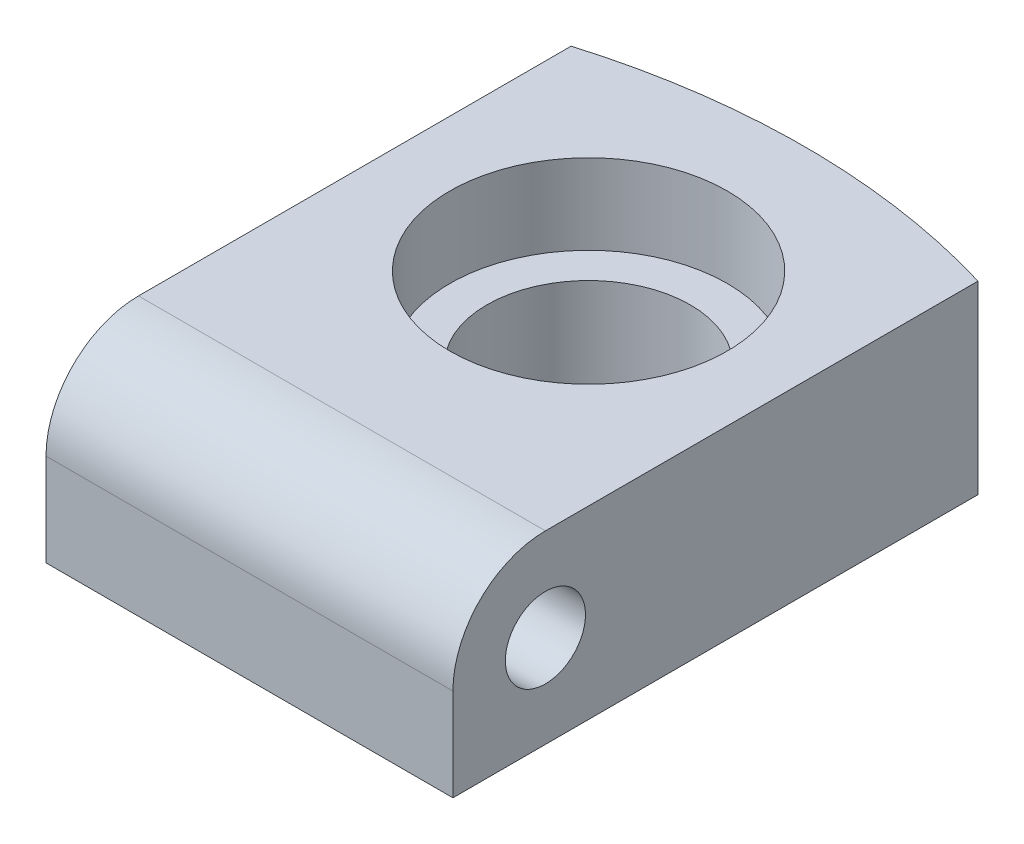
ISO-10303-21;
HEADER;
FILE_DESCRIPTION(('STEP AP214'),'2;1');
FILE_NAME('part.step','',(''),(''),'','','');
FILE_SCHEMA(('AUTOMOTIVE_DESIGN { 1 0 10303 214 1 1 1 1 }'));
ENDSEC;
DATA;
#1=APPLICATION_CONTEXT('core data for automotive mechanical design processes');
#2=APPLICATION_PROTOCOL_DEFINITION('international standard','automotive_design',2000,#1);
#3=PRODUCT_CONTEXT('',#1,'mechanical');
#4=PRODUCT('Part','Part','',(#3));
#5=PRODUCT_RELATED_PRODUCT_CATEGORY('part','',(#4));
#6=PRODUCT_DEFINITION_FORMATION('','',#4);
#7=PRODUCT_DEFINITION_CONTEXT('part definition',#1,'design');
#8=PRODUCT_DEFINITION('design','',#6,#7);
#9=PRODUCT_DEFINITION_SHAPE('','',#8);
#10=(LENGTH_UNIT() NAMED_UNIT(*) SI_UNIT(.MILLI.,.METRE.));
#11=(NAMED_UNIT(*) PLANE_ANGLE_UNIT() SI_UNIT($,.RADIAN.));
#12=(NAMED_UNIT(*) SI_UNIT($,.STERADIAN.) SOLID_ANGLE_UNIT());
#13=UNCERTAINTY_MEASURE_WITH_UNIT(LENGTH_MEASURE(1.E-05),#10,'distance_accuracy_value','');
#14=(GEOMETRIC_REPRESENTATION_CONTEXT(3) GLOBAL_UNCERTAINTY_ASSIGNED_CONTEXT((#13)) GLOBAL_UNIT_ASSIGNED_CONTEXT((#10,
#11,#12)) REPRESENTATION_CONTEXT('',''));
#15=CARTESIAN_POINT('',(0.,0.,0.));
#16=DIRECTION('',(0.,0.,1.));
#17=DIRECTION('',(1.,0.,0.));
#18=AXIS2_PLACEMENT_3D('',#15,#16,#17);
#19=CARTESIAN_POINT('',(-66.,0.,0.));
#20=DIRECTION('',(0.,-1.,0.));
#21=DIRECTION('',(0.,0.,-1.));
#22=AXIS2_PLACEMENT_3D('',#19,#20,#21);
#23=PLANE('',#22);
#24=CARTESIAN_POINT('',(-33.,0.,35.));
#25=DIRECTION('',(0.,1.,0.));
#26=DIRECTION('',(0.,0.,1.));
#27=AXIS2_PLACEMENT_3D('',#24,#25,#26);
#28=CIRCLE('',#27,16.5);
#29=CARTESIAN_POINT('',(-33.,0.,51.5));
#30=VERTEX_POINT('',#29);
#31=EDGE_CURVE('E145',#30,#30,#28,.T.);
#32=ORIENTED_EDGE('',*,*,#31,.T.);
#33=EDGE_LOOP('',(#32));
#34=FACE_BOUND('',#33,.T.);
#35=CARTESIAN_POINT('',(-33.,0.,115.));
#36=DIRECTION('',(0.,1.,0.));
#37=DIRECTION('',(0.,0.,1.));
#38=AXIS2_PLACEMENT_3D('',#35,#36,#37);
#39=CIRCLE('',#38,115.);
#40=CARTESIAN_POINT('',(-66.,0.,4.83648516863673));
#41=VERTEX_POINT('',#40);
#42=CARTESIAN_POINT('',(0.,0.,4.83648516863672));
#43=VERTEX_POINT('',#42);
#44=EDGE_CURVE('E68',#41,#43,#39,.F.);
#45=ORIENTED_EDGE('',*,*,#44,.T.);
#46=DIRECTION('',(0.,0.,-1.));
#47=VECTOR('',#46,1.);
#48=CARTESIAN_POINT('',(0.,0.,0.));
#49=LINE('',#48,#47);
#50=CARTESIAN_POINT('',(0.,0.,90.));
#51=VERTEX_POINT('',#50);
#52=EDGE_CURVE('E118',#51,#43,#49,.T.);
#53=ORIENTED_EDGE('',*,*,#52,.F.);
#54=DIRECTION('',(1.,0.,0.));
#55=VECTOR('',#54,1.);
#56=CARTESIAN_POINT('',(-66.,0.,90.));
#57=LINE('',#56,#55);
#58=CARTESIAN_POINT('',(-66.,0.,90.));
#59=VERTEX_POINT('',#58);
#60=EDGE_CURVE('E12',#59,#51,#57,.T.);
#61=ORIENTED_EDGE('',*,*,#60,.F.);
#62=DIRECTION('',(0.,0.,-1.));
#63=VECTOR('',#62,1.);
#64=CARTESIAN_POINT('',(-66.,0.,0.));
#65=LINE('',#64,#63);
#66=EDGE_CURVE('E130',#59,#41,#65,.T.);
#67=ORIENTED_EDGE('',*,*,#66,.T.);
#68=EDGE_LOOP('',(#45,#53,#61,#67));
#69=FACE_BOUND('',#68,.T.);
#70=ADVANCED_FACE('F51',(#34,#69),#23,.T.);
#71=CARTESIAN_POINT('',(-66.,30.,0.));
#72=DIRECTION('',(0.,1.,0.));
#73=DIRECTION('',(0.,0.,1.));
#74=AXIS2_PLACEMENT_3D('',#71,#72,#73);
#75=PLANE('',#74);
#76=CARTESIAN_POINT('',(-33.,30.,35.));
#77=DIRECTION('',(0.,1.,0.));
#78=DIRECTION('',(0.,0.,1.));
#79=AXIS2_PLACEMENT_3D('',#76,#77,#78);
#80=CIRCLE('',#79,22.5);
#81=CARTESIAN_POINT('',(-33.,30.,57.5));
#82=VERTEX_POINT('',#81);
#83=EDGE_CURVE('E154',#82,#82,#80,.T.);
#84=ORIENTED_EDGE('',*,*,#83,.F.);
#85=EDGE_LOOP('',(#84));
#86=FACE_BOUND('',#85,.T.);
#87=DIRECTION('',(0.,0.,1.));
#88=VECTOR('',#87,1.);
#89=CARTESIAN_POINT('',(0.,30.,0.));
#90=LINE('',#89,#88);
#91=CARTESIAN_POINT('',(0.,30.,4.83648516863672));
#92=VERTEX_POINT('',#91);
#93=CARTESIAN_POINT('',(0.,30.,74.9999999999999));
#94=VERTEX_POINT('',#93);
#95=EDGE_CURVE('E117',#92,#94,#90,.T.);
#96=ORIENTED_EDGE('',*,*,#95,.F.);
#97=CARTESIAN_POINT('',(-33.,30.,115.));
#98=DIRECTION('',(0.,1.,0.));
#99=DIRECTION('',(0.,0.,1.));
#100=AXIS2_PLACEMENT_3D('',#97,#98,#99);
#101=CIRCLE('',#100,115.);
#102=CARTESIAN_POINT('',(-66.,30.,4.83648516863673));
#103=VERTEX_POINT('',#102);
#104=EDGE_CURVE('E105',#103,#92,#101,.F.);
#105=ORIENTED_EDGE('',*,*,#104,.F.);
#106=DIRECTION('',(0.,0.,1.));
#107=VECTOR('',#106,1.);
#108=CARTESIAN_POINT('',(-66.,30.,0.));
#109=LINE('',#108,#107);
#110=CARTESIAN_POINT('',(-66.,30.,74.9999999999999));
#111=VERTEX_POINT('',#110);
#112=EDGE_CURVE('E97',#103,#111,#109,.T.);
#113=ORIENTED_EDGE('',*,*,#112,.T.);
#114=DIRECTION('',(1.,0.,0.));
#115=VECTOR('',#114,1.);
#116=CARTESIAN_POINT('',(-66.,30.,74.9999999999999));
#117=LINE('',#116,#115);
#118=EDGE_CURVE('E55',#111,#94,#117,.T.);
#119=ORIENTED_EDGE('',*,*,#118,.T.);
#120=EDGE_LOOP('',(#96,#105,#113,#119));
#121=FACE_BOUND('',#120,.T.);
#122=ADVANCED_FACE('F53',(#86,#121),#75,.T.);
#123=CARTESIAN_POINT('',(-66.,0.,90.));
#124=DIRECTION('',(0.,0.,1.));
#125=DIRECTION('',(1.,0.,0.));
#126=AXIS2_PLACEMENT_3D('',#123,#124,#125);
#127=PLANE('',#126);
#128=DIRECTION('',(0.,-1.,0.));
#129=VECTOR('',#128,1.);
#130=CARTESIAN_POINT('',(0.,0.,90.));
#131=LINE('',#130,#129);
#132=CARTESIAN_POINT('',(0.,14.9999999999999,90.));
#133=VERTEX_POINT('',#132);
#134=EDGE_CURVE('E124',#133,#51,#131,.T.);
#135=ORIENTED_EDGE('',*,*,#134,.F.);
#136=DIRECTION('',(1.,0.,0.));
#137=VECTOR('',#136,1.);
#138=CARTESIAN_POINT('',(-66.,14.9999999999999,90.));
#139=LINE('',#138,#137);
#140=CARTESIAN_POINT('',(-66.,14.9999999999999,90.));
#141=VERTEX_POINT('',#140);
#142=EDGE_CURVE('E60',#141,#133,#139,.T.);
#143=ORIENTED_EDGE('',*,*,#142,.F.);
#144=DIRECTION('',(0.,-1.,0.));
#145=VECTOR('',#144,1.);
#146=CARTESIAN_POINT('',(-66.,0.,90.));
#147=LINE('',#146,#145);
#148=EDGE_CURVE('E136',#141,#59,#147,.T.);
#149=ORIENTED_EDGE('',*,*,#148,.T.);
#150=ORIENTED_EDGE('',*,*,#60,.T.);
#151=EDGE_LOOP('',(#135,#143,#149,#150));
#152=FACE_BOUND('',#151,.T.);
#153=ADVANCED_FACE('F164',(#152),#127,.T.);
#154=CARTESIAN_POINT('',(-66.,15.,75.));
#155=DIRECTION('',(1.,0.,0.));
#156=DIRECTION('',(0.,0.,-1.));
#157=AXIS2_PLACEMENT_3D('',#154,#155,#156);
#158=CYLINDRICAL_SURFACE('',#157,15.);
#159=CARTESIAN_POINT('',(0.,15.,75.));
#160=DIRECTION('',(1.,0.,0.));
#161=DIRECTION('',(0.,0.,-1.));
#162=AXIS2_PLACEMENT_3D('',#159,#160,#161);
#163=CIRCLE('',#162,15.);
#164=EDGE_CURVE('E121',#94,#133,#163,.T.);
#165=ORIENTED_EDGE('',*,*,#164,.F.);
#166=ORIENTED_EDGE('',*,*,#118,.F.);
#167=CARTESIAN_POINT('',(-66.,15.,75.));
#168=DIRECTION('',(1.,0.,0.));
#169=DIRECTION('',(0.,0.,-1.));
#170=AXIS2_PLACEMENT_3D('',#167,#168,#169);
#171=CIRCLE('',#170,15.);
#172=EDGE_CURVE('E138',#111,#141,#171,.T.);
#173=ORIENTED_EDGE('',*,*,#172,.T.);
#174=ORIENTED_EDGE('',*,*,#142,.T.);
#175=EDGE_LOOP('',(#165,#166,#173,#174));
#176=FACE_BOUND('',#175,.T.);
#177=ADVANCED_FACE('F170',(#176),#158,.T.);
#178=CARTESIAN_POINT('',(-66.,15.,75.));
#179=DIRECTION('',(1.,0.,0.));
#180=DIRECTION('',(0.,0.,-1.));
#181=AXIS2_PLACEMENT_3D('',#178,#179,#180);
#182=PLANE('',#181);
#183=CARTESIAN_POINT('',(-66.,15.,75.));
#184=DIRECTION('',(1.,0.,0.));
#185=DIRECTION('',(0.,0.,-1.));
#186=AXIS2_PLACEMENT_3D('',#183,#184,#185);
#187=CIRCLE('',#186,6.49999999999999);
#188=CARTESIAN_POINT('',(-66.,15.,68.5));
#189=VERTEX_POINT('',#188);
#190=EDGE_CURVE('E122',#189,#189,#187,.T.);
#191=ORIENTED_EDGE('',*,*,#190,.T.);
#192=EDGE_LOOP('',(#191));
#193=FACE_BOUND('',#192,.T.);
#194=ORIENTED_EDGE('',*,*,#112,.F.);
#195=DIRECTION('',(0.,1.,0.));
#196=VECTOR('',#195,1.);
#197=CARTESIAN_POINT('',(-66.,0.,4.83648516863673));
#198=LINE('',#197,#196);
#199=EDGE_CURVE('E110',#41,#103,#198,.T.);
#200=ORIENTED_EDGE('',*,*,#199,.F.);
#201=ORIENTED_EDGE('',*,*,#66,.F.);
#202=ORIENTED_EDGE('',*,*,#148,.F.);
#203=ORIENTED_EDGE('',*,*,#172,.F.);
#204=EDGE_LOOP('',(#194,#200,#201,#202,#203));
#205=FACE_BOUND('',#204,.T.);
#206=ADVANCED_FACE('F172',(#193,#205),#182,.F.);
#207=CARTESIAN_POINT('',(0.,15.,75.));
#208=DIRECTION('',(1.,0.,0.));
#209=DIRECTION('',(0.,0.,-1.));
#210=AXIS2_PLACEMENT_3D('',#207,#208,#209);
#211=PLANE('',#210);
#212=DIRECTION('',(0.,1.,0.));
#213=VECTOR('',#212,1.);
#214=CARTESIAN_POINT('',(0.,0.,4.83648516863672));
#215=LINE('',#214,#213);
#216=EDGE_CURVE('E108',#43,#92,#215,.T.);
#217=ORIENTED_EDGE('',*,*,#216,.T.);
#218=ORIENTED_EDGE('',*,*,#95,.T.);
#219=ORIENTED_EDGE('',*,*,#164,.T.);
#220=ORIENTED_EDGE('',*,*,#134,.T.);
#221=ORIENTED_EDGE('',*,*,#52,.T.);
#222=EDGE_LOOP('',(#217,#218,#219,#220,#221));
#223=FACE_BOUND('',#222,.T.);
#224=CARTESIAN_POINT('',(0.,15.,75.));
#225=DIRECTION('',(1.,0.,0.));
#226=DIRECTION('',(0.,0.,-1.));
#227=AXIS2_PLACEMENT_3D('',#224,#225,#226);
#228=CIRCLE('',#227,6.49999999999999);
#229=CARTESIAN_POINT('',(0.,15.,68.5));
#230=VERTEX_POINT('',#229);
#231=EDGE_CURVE('E127',#230,#230,#228,.T.);
#232=ORIENTED_EDGE('',*,*,#231,.F.);
#233=EDGE_LOOP('',(#232));
#234=FACE_BOUND('',#233,.T.);
#235=ADVANCED_FACE('F114',(#223,#234),#211,.T.);
#236=CARTESIAN_POINT('',(0.,15.,75.));
#237=DIRECTION('',(1.,0.,0.));
#238=DIRECTION('',(0.,0.,-1.));
#239=AXIS2_PLACEMENT_3D('',#236,#237,#238);
#240=CYLINDRICAL_SURFACE('',#239,6.49999999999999);
#241=ORIENTED_EDGE('',*,*,#190,.F.);
#242=EDGE_LOOP('',(#241));
#243=FACE_BOUND('',#242,.T.);
#244=ORIENTED_EDGE('',*,*,#231,.T.);
#245=EDGE_LOOP('',(#244));
#246=FACE_BOUND('',#245,.T.);
#247=ADVANCED_FACE('F182',(#243,#246),#240,.F.);
#248=CARTESIAN_POINT('',(-33.,30.,35.));
#249=DIRECTION('',(0.,1.,0.));
#250=DIRECTION('',(0.,0.,1.));
#251=AXIS2_PLACEMENT_3D('',#248,#249,#250);
#252=CYLINDRICAL_SURFACE('',#251,16.5);
#253=ORIENTED_EDGE('',*,*,#31,.F.);
#254=EDGE_LOOP('',(#253));
#255=FACE_BOUND('',#254,.T.);
#256=CARTESIAN_POINT('',(-33.,17.,35.));
#257=DIRECTION('',(0.,1.,0.));
#258=DIRECTION('',(0.,0.,1.));
#259=AXIS2_PLACEMENT_3D('',#256,#257,#258);
#260=CIRCLE('',#259,16.5);
#261=CARTESIAN_POINT('',(-33.,17.,51.5));
#262=VERTEX_POINT('',#261);
#263=EDGE_CURVE('E148',#262,#262,#260,.T.);
#264=ORIENTED_EDGE('',*,*,#263,.T.);
#265=EDGE_LOOP('',(#264));
#266=FACE_BOUND('',#265,.T.);
#267=ADVANCED_FACE('F186',(#255,#266),#252,.F.);
#268=CARTESIAN_POINT('',(-16.5,17.,35.));
#269=DIRECTION('',(0.,-1.,0.));
#270=DIRECTION('',(0.,0.,-1.));
#271=AXIS2_PLACEMENT_3D('',#268,#269,#270);
#272=PLANE('',#271);
#273=ORIENTED_EDGE('',*,*,#263,.F.);
#274=EDGE_LOOP('',(#273));
#275=FACE_BOUND('',#274,.T.);
#276=CARTESIAN_POINT('',(-33.,17.,35.));
#277=DIRECTION('',(0.,1.,0.));
#278=DIRECTION('',(0.,0.,1.));
#279=AXIS2_PLACEMENT_3D('',#276,#277,#278);
#280=CIRCLE('',#279,22.5);
#281=CARTESIAN_POINT('',(-33.,17.,57.5));
#282=VERTEX_POINT('',#281);
#283=EDGE_CURVE('E151',#282,#282,#280,.T.);
#284=ORIENTED_EDGE('',*,*,#283,.T.);
#285=EDGE_LOOP('',(#284));
#286=FACE_BOUND('',#285,.T.);
#287=ADVANCED_FACE('F190',(#275,#286),#272,.F.);
#288=CARTESIAN_POINT('',(-33.,30.,35.));
#289=DIRECTION('',(0.,1.,0.));
#290=DIRECTION('',(0.,0.,1.));
#291=AXIS2_PLACEMENT_3D('',#288,#289,#290);
#292=CYLINDRICAL_SURFACE('',#291,22.5);
#293=ORIENTED_EDGE('',*,*,#283,.F.);
#294=EDGE_LOOP('',(#293));
#295=FACE_BOUND('',#294,.T.);
#296=ORIENTED_EDGE('',*,*,#83,.T.);
#297=EDGE_LOOP('',(#296));
#298=FACE_BOUND('',#297,.T.);
#299=ADVANCED_FACE('F194',(#295,#298),#292,.F.);
#300=CARTESIAN_POINT('',(-33.,0.,115.));
#301=DIRECTION('',(0.,1.,0.));
#302=DIRECTION('',(0.,0.,1.));
#303=AXIS2_PLACEMENT_3D('',#300,#301,#302);
#304=CYLINDRICAL_SURFACE('',#303,115.);
#305=ORIENTED_EDGE('',*,*,#104,.T.);
#306=ORIENTED_EDGE('',*,*,#216,.F.);
#307=ORIENTED_EDGE('',*,*,#44,.F.);
#308=ORIENTED_EDGE('',*,*,#199,.T.);
#309=EDGE_LOOP('',(#305,#306,#307,#308));
#310=FACE_BOUND('',#309,.T.);
#311=ADVANCED_FACE('F107',(#310),#304,.T.);
#312=CLOSED_SHELL('',(#70,#122,#153,#177,#206,#235,#247,#267,#287,#299,#311));
#313=MANIFOLD_SOLID_BREP('B2',#312);
#314=ADVANCED_BREP_SHAPE_REPRESENTATION('',(#18,#313),#14);
#315=SHAPE_DEFINITION_REPRESENTATION(#9,#314);
ENDSEC;
END-ISO-10303-21;
